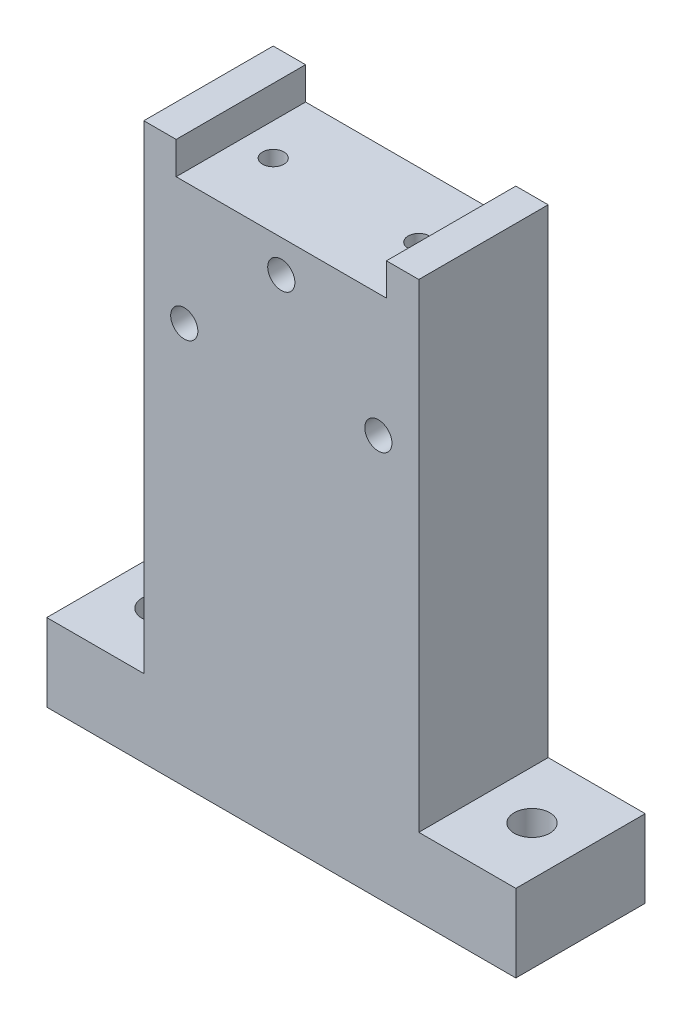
ISO-10303-21;
HEADER;
FILE_DESCRIPTION(('STEP AP214'),'2;1');
FILE_NAME('part.step','',(''),(''),'','','');
FILE_SCHEMA(('AUTOMOTIVE_DESIGN { 1 0 10303 214 1 1 1 1 }'));
ENDSEC;
DATA;
#1=APPLICATION_CONTEXT('core data for automotive mechanical design processes');
#2=APPLICATION_PROTOCOL_DEFINITION('international standard','automotive_design',2000,#1);
#3=PRODUCT_CONTEXT('',#1,'mechanical');
#4=PRODUCT('Part','Part','',(#3));
#5=PRODUCT_RELATED_PRODUCT_CATEGORY('part','',(#4));
#6=PRODUCT_DEFINITION_FORMATION('','',#4);
#7=PRODUCT_DEFINITION_CONTEXT('part definition',#1,'design');
#8=PRODUCT_DEFINITION('design','',#6,#7);
#9=PRODUCT_DEFINITION_SHAPE('','',#8);
#10=(LENGTH_UNIT() NAMED_UNIT(*) SI_UNIT(.MILLI.,.METRE.));
#11=(NAMED_UNIT(*) PLANE_ANGLE_UNIT() SI_UNIT($,.RADIAN.));
#12=(NAMED_UNIT(*) SI_UNIT($,.STERADIAN.) SOLID_ANGLE_UNIT());
#13=UNCERTAINTY_MEASURE_WITH_UNIT(LENGTH_MEASURE(1.E-05),#10,'distance_accuracy_value','');
#14=(GEOMETRIC_REPRESENTATION_CONTEXT(3) GLOBAL_UNCERTAINTY_ASSIGNED_CONTEXT((#13)) GLOBAL_UNIT_ASSIGNED_CONTEXT((#10,
#11,#12)) REPRESENTATION_CONTEXT('',''));
#15=CARTESIAN_POINT('',(0.,0.,0.));
#16=DIRECTION('',(0.,0.,1.));
#17=DIRECTION('',(1.,0.,0.));
#18=AXIS2_PLACEMENT_3D('',#15,#16,#17);
#19=CARTESIAN_POINT('',(20.0000000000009,80.9999999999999,20.));
#20=DIRECTION('',(0.,-1.,0.));
#21=DIRECTION('',(0.,0.,-1.));
#22=AXIS2_PLACEMENT_3D('',#19,#20,#21);
#23=PLANE('',#22);
#24=CARTESIAN_POINT('',(47.5,80.9999999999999,10.));
#25=DIRECTION('',(0.,1.,0.));
#26=DIRECTION('',(0.,0.,1.));
#27=AXIS2_PLACEMENT_3D('',#24,#25,#26);
#28=CIRCLE('',#27,1.65000000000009);
#29=CARTESIAN_POINT('',(47.5,80.9999999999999,11.6500000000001));
#30=VERTEX_POINT('',#29);
#31=EDGE_CURVE('E264',#30,#30,#28,.T.);
#32=ORIENTED_EDGE('',*,*,#31,.F.);
#33=EDGE_LOOP('',(#32));
#34=FACE_BOUND('',#33,.T.);
#35=CARTESIAN_POINT('',(25.,80.9999999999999,10.));
#36=DIRECTION('',(0.,1.,0.));
#37=DIRECTION('',(0.,0.,1.));
#38=AXIS2_PLACEMENT_3D('',#35,#36,#37);
#39=CIRCLE('',#38,1.65000000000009);
#40=CARTESIAN_POINT('',(25.,80.9999999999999,11.6500000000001));
#41=VERTEX_POINT('',#40);
#42=EDGE_CURVE('E267',#41,#41,#39,.T.);
#43=ORIENTED_EDGE('',*,*,#42,.F.);
#44=EDGE_LOOP('',(#43));
#45=FACE_BOUND('',#44,.T.);
#46=DIRECTION('',(-1.,0.,0.));
#47=VECTOR('',#46,1.);
#48=CARTESIAN_POINT('',(20.0000000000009,80.9999999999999,0.));
#49=LINE('',#48,#47);
#50=CARTESIAN_POINT('',(52.5000000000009,80.9999999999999,0.));
#51=VERTEX_POINT('',#50);
#52=CARTESIAN_POINT('',(20.0000000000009,80.9999999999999,0.));
#53=VERTEX_POINT('',#52);
#54=EDGE_CURVE('E153',#51,#53,#49,.T.);
#55=ORIENTED_EDGE('',*,*,#54,.T.);
#56=DIRECTION('',(0.,0.,-1.));
#57=VECTOR('',#56,1.);
#58=CARTESIAN_POINT('',(20.0000000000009,80.9999999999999,20.));
#59=LINE('',#58,#57);
#60=CARTESIAN_POINT('',(20.0000000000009,80.9999999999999,20.));
#61=VERTEX_POINT('',#60);
#62=EDGE_CURVE('E11',#61,#53,#59,.T.);
#63=ORIENTED_EDGE('',*,*,#62,.F.);
#64=DIRECTION('',(-1.,0.,0.));
#65=VECTOR('',#64,1.);
#66=CARTESIAN_POINT('',(20.0000000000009,80.9999999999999,20.));
#67=LINE('',#66,#65);
#68=CARTESIAN_POINT('',(52.5000000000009,80.9999999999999,20.));
#69=VERTEX_POINT('',#68);
#70=EDGE_CURVE('E176',#69,#61,#67,.T.);
#71=ORIENTED_EDGE('',*,*,#70,.F.);
#72=DIRECTION('',(0.,0.,-1.));
#73=VECTOR('',#72,1.);
#74=CARTESIAN_POINT('',(52.5000000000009,80.9999999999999,20.));
#75=LINE('',#74,#73);
#76=EDGE_CURVE('E149',#69,#51,#75,.T.);
#77=ORIENTED_EDGE('',*,*,#76,.T.);
#78=EDGE_LOOP('',(#55,#63,#71,#77));
#79=FACE_BOUND('',#78,.T.);
#80=ADVANCED_FACE('F32',(#34,#45,#79),#23,.F.);
#81=CARTESIAN_POINT('',(20.0000000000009,80.9999999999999,20.));
#82=DIRECTION('',(-1.,-1.8179902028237E-13,0.));
#83=DIRECTION('',(1.8179902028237E-13,-1.,0.));
#84=AXIS2_PLACEMENT_3D('',#81,#82,#83);
#85=PLANE('',#84);
#86=DIRECTION('',(-1.8179902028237E-13,1.,0.));
#87=VECTOR('',#86,1.);
#88=CARTESIAN_POINT('',(20.0000000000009,80.9999999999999,0.));
#89=LINE('',#88,#87);
#90=CARTESIAN_POINT('',(20.,85.9999999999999,0.));
#91=VERTEX_POINT('',#90);
#92=EDGE_CURVE('E156',#53,#91,#89,.T.);
#93=ORIENTED_EDGE('',*,*,#92,.T.);
#94=DIRECTION('',(0.,0.,-1.));
#95=VECTOR('',#94,1.);
#96=CARTESIAN_POINT('',(20.,85.9999999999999,20.));
#97=LINE('',#96,#95);
#98=CARTESIAN_POINT('',(20.,85.9999999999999,20.));
#99=VERTEX_POINT('',#98);
#100=EDGE_CURVE('E41',#99,#91,#97,.T.);
#101=ORIENTED_EDGE('',*,*,#100,.F.);
#102=DIRECTION('',(-1.8179902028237E-13,1.,0.));
#103=VECTOR('',#102,1.);
#104=CARTESIAN_POINT('',(20.0000000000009,80.9999999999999,20.));
#105=LINE('',#104,#103);
#106=EDGE_CURVE('E104',#61,#99,#105,.T.);
#107=ORIENTED_EDGE('',*,*,#106,.F.);
#108=ORIENTED_EDGE('',*,*,#62,.T.);
#109=EDGE_LOOP('',(#93,#101,#107,#108));
#110=FACE_BOUND('',#109,.T.);
#111=ADVANCED_FACE('F256',(#110),#85,.F.);
#112=CARTESIAN_POINT('',(15.,85.9999999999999,20.));
#113=DIRECTION('',(0.,-1.,0.));
#114=DIRECTION('',(0.,0.,-1.));
#115=AXIS2_PLACEMENT_3D('',#112,#113,#114);
#116=PLANE('',#115);
#117=DIRECTION('',(-1.,0.,0.));
#118=VECTOR('',#117,1.);
#119=CARTESIAN_POINT('',(15.,85.9999999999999,0.));
#120=LINE('',#119,#118);
#121=CARTESIAN_POINT('',(15.,85.9999999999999,0.));
#122=VERTEX_POINT('',#121);
#123=EDGE_CURVE('E159',#91,#122,#120,.T.);
#124=ORIENTED_EDGE('',*,*,#123,.T.);
#125=DIRECTION('',(0.,0.,-1.));
#126=VECTOR('',#125,1.);
#127=CARTESIAN_POINT('',(15.,85.9999999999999,20.));
#128=LINE('',#127,#126);
#129=CARTESIAN_POINT('',(15.,85.9999999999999,20.));
#130=VERTEX_POINT('',#129);
#131=EDGE_CURVE('E195',#130,#122,#128,.T.);
#132=ORIENTED_EDGE('',*,*,#131,.F.);
#133=DIRECTION('',(-1.,0.,0.));
#134=VECTOR('',#133,1.);
#135=CARTESIAN_POINT('',(15.,85.9999999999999,20.));
#136=LINE('',#135,#134);
#137=EDGE_CURVE('E204',#99,#130,#136,.T.);
#138=ORIENTED_EDGE('',*,*,#137,.F.);
#139=ORIENTED_EDGE('',*,*,#100,.T.);
#140=EDGE_LOOP('',(#124,#132,#138,#139));
#141=FACE_BOUND('',#140,.T.);
#142=ADVANCED_FACE('F202',(#141),#116,.F.);
#143=CARTESIAN_POINT('',(15.,12.,20.));
#144=DIRECTION('',(1.,0.,0.));
#145=DIRECTION('',(0.,0.,-1.));
#146=AXIS2_PLACEMENT_3D('',#143,#144,#145);
#147=PLANE('',#146);
#148=DIRECTION('',(0.,-1.,0.));
#149=VECTOR('',#148,1.);
#150=CARTESIAN_POINT('',(15.,12.,0.));
#151=LINE('',#150,#149);
#152=CARTESIAN_POINT('',(15.,12.,0.));
#153=VERTEX_POINT('',#152);
#154=EDGE_CURVE('E161',#122,#153,#151,.T.);
#155=ORIENTED_EDGE('',*,*,#154,.T.);
#156=DIRECTION('',(0.,0.,-1.));
#157=VECTOR('',#156,1.);
#158=CARTESIAN_POINT('',(15.,12.,20.));
#159=LINE('',#158,#157);
#160=CARTESIAN_POINT('',(15.,12.,20.));
#161=VERTEX_POINT('',#160);
#162=EDGE_CURVE('E192',#161,#153,#159,.T.);
#163=ORIENTED_EDGE('',*,*,#162,.F.);
#164=DIRECTION('',(0.,-1.,0.));
#165=VECTOR('',#164,1.);
#166=CARTESIAN_POINT('',(15.,12.,20.));
#167=LINE('',#166,#165);
#168=EDGE_CURVE('E222',#130,#161,#167,.T.);
#169=ORIENTED_EDGE('',*,*,#168,.F.);
#170=ORIENTED_EDGE('',*,*,#131,.T.);
#171=EDGE_LOOP('',(#155,#163,#169,#170));
#172=FACE_BOUND('',#171,.T.);
#173=ADVANCED_FACE('F213',(#172),#147,.F.);
#174=CARTESIAN_POINT('',(0.,12.,20.));
#175=DIRECTION('',(0.,-1.,0.));
#176=DIRECTION('',(0.,0.,-1.));
#177=AXIS2_PLACEMENT_3D('',#174,#175,#176);
#178=PLANE('',#177);
#179=CARTESIAN_POINT('',(7.5,12.,10.));
#180=DIRECTION('',(0.,1.,0.));
#181=DIRECTION('',(0.,0.,1.));
#182=AXIS2_PLACEMENT_3D('',#179,#180,#181);
#183=CIRCLE('',#182,2.75);
#184=CARTESIAN_POINT('',(7.5,12.,12.75));
#185=VERTEX_POINT('',#184);
#186=EDGE_CURVE('E284',#185,#185,#183,.T.);
#187=ORIENTED_EDGE('',*,*,#186,.F.);
#188=EDGE_LOOP('',(#187));
#189=FACE_BOUND('',#188,.T.);
#190=DIRECTION('',(-1.,0.,0.));
#191=VECTOR('',#190,1.);
#192=CARTESIAN_POINT('',(0.,12.,0.));
#193=LINE('',#192,#191);
#194=CARTESIAN_POINT('',(0.,12.,0.));
#195=VERTEX_POINT('',#194);
#196=EDGE_CURVE('E163',#153,#195,#193,.T.);
#197=ORIENTED_EDGE('',*,*,#196,.T.);
#198=DIRECTION('',(0.,0.,-1.));
#199=VECTOR('',#198,1.);
#200=CARTESIAN_POINT('',(0.,12.,20.));
#201=LINE('',#200,#199);
#202=CARTESIAN_POINT('',(0.,12.,20.));
#203=VERTEX_POINT('',#202);
#204=EDGE_CURVE('E189',#203,#195,#201,.T.);
#205=ORIENTED_EDGE('',*,*,#204,.F.);
#206=DIRECTION('',(-1.,0.,0.));
#207=VECTOR('',#206,1.);
#208=CARTESIAN_POINT('',(0.,12.,20.));
#209=LINE('',#208,#207);
#210=EDGE_CURVE('E219',#161,#203,#209,.T.);
#211=ORIENTED_EDGE('',*,*,#210,.F.);
#212=ORIENTED_EDGE('',*,*,#162,.T.);
#213=EDGE_LOOP('',(#197,#205,#211,#212));
#214=FACE_BOUND('',#213,.T.);
#215=ADVANCED_FACE('F217',(#189,#214),#178,.F.);
#216=CARTESIAN_POINT('',(0.,0.,20.));
#217=DIRECTION('',(1.,0.,0.));
#218=DIRECTION('',(0.,0.,-1.));
#219=AXIS2_PLACEMENT_3D('',#216,#217,#218);
#220=PLANE('',#219);
#221=DIRECTION('',(0.,-1.,0.));
#222=VECTOR('',#221,1.);
#223=CARTESIAN_POINT('',(0.,0.,0.));
#224=LINE('',#223,#222);
#225=CARTESIAN_POINT('',(0.,0.,0.));
#226=VERTEX_POINT('',#225);
#227=EDGE_CURVE('E165',#195,#226,#224,.T.);
#228=ORIENTED_EDGE('',*,*,#227,.T.);
#229=DIRECTION('',(0.,0.,-1.));
#230=VECTOR('',#229,1.);
#231=CARTESIAN_POINT('',(0.,0.,20.));
#232=LINE('',#231,#230);
#233=CARTESIAN_POINT('',(0.,0.,20.));
#234=VERTEX_POINT('',#233);
#235=EDGE_CURVE('E186',#234,#226,#232,.T.);
#236=ORIENTED_EDGE('',*,*,#235,.F.);
#237=DIRECTION('',(0.,-1.,0.));
#238=VECTOR('',#237,1.);
#239=CARTESIAN_POINT('',(0.,0.,20.));
#240=LINE('',#239,#238);
#241=EDGE_CURVE('E221',#203,#234,#240,.T.);
#242=ORIENTED_EDGE('',*,*,#241,.F.);
#243=ORIENTED_EDGE('',*,*,#204,.T.);
#244=EDGE_LOOP('',(#228,#236,#242,#243));
#245=FACE_BOUND('',#244,.T.);
#246=ADVANCED_FACE('F435',(#245),#220,.F.);
#247=CARTESIAN_POINT('',(0.,0.,20.));
#248=DIRECTION('',(0.,1.,0.));
#249=DIRECTION('',(0.,0.,1.));
#250=AXIS2_PLACEMENT_3D('',#247,#248,#249);
#251=PLANE('',#250);
#252=CARTESIAN_POINT('',(65.,0.,10.));
#253=DIRECTION('',(0.,1.,0.));
#254=DIRECTION('',(0.,0.,1.));
#255=AXIS2_PLACEMENT_3D('',#252,#253,#254);
#256=CIRCLE('',#255,2.75);
#257=CARTESIAN_POINT('',(65.,0.,12.75));
#258=VERTEX_POINT('',#257);
#259=EDGE_CURVE('E281',#258,#258,#256,.T.);
#260=ORIENTED_EDGE('',*,*,#259,.T.);
#261=EDGE_LOOP('',(#260));
#262=FACE_BOUND('',#261,.T.);
#263=CARTESIAN_POINT('',(7.5,0.,10.));
#264=DIRECTION('',(0.,1.,0.));
#265=DIRECTION('',(0.,0.,1.));
#266=AXIS2_PLACEMENT_3D('',#263,#264,#265);
#267=CIRCLE('',#266,2.75);
#268=CARTESIAN_POINT('',(7.5,0.,12.75));
#269=VERTEX_POINT('',#268);
#270=EDGE_CURVE('E35',#269,#269,#267,.T.);
#271=ORIENTED_EDGE('',*,*,#270,.T.);
#272=EDGE_LOOP('',(#271));
#273=FACE_BOUND('',#272,.T.);
#274=DIRECTION('',(1.,0.,0.));
#275=VECTOR('',#274,1.);
#276=CARTESIAN_POINT('',(0.,0.,0.));
#277=LINE('',#276,#275);
#278=CARTESIAN_POINT('',(72.5,0.,0.));
#279=VERTEX_POINT('',#278);
#280=EDGE_CURVE('E167',#226,#279,#277,.T.);
#281=ORIENTED_EDGE('',*,*,#280,.T.);
#282=DIRECTION('',(0.,0.,-1.));
#283=VECTOR('',#282,1.);
#284=CARTESIAN_POINT('',(72.5,0.,20.));
#285=LINE('',#284,#283);
#286=CARTESIAN_POINT('',(72.5,0.,20.));
#287=VERTEX_POINT('',#286);
#288=EDGE_CURVE('E183',#287,#279,#285,.T.);
#289=ORIENTED_EDGE('',*,*,#288,.F.);
#290=DIRECTION('',(1.,0.,0.));
#291=VECTOR('',#290,1.);
#292=CARTESIAN_POINT('',(0.,0.,20.));
#293=LINE('',#292,#291);
#294=EDGE_CURVE('E224',#234,#287,#293,.T.);
#295=ORIENTED_EDGE('',*,*,#294,.F.);
#296=ORIENTED_EDGE('',*,*,#235,.T.);
#297=EDGE_LOOP('',(#281,#289,#295,#296));
#298=FACE_BOUND('',#297,.T.);
#299=ADVANCED_FACE('F428',(#262,#273,#298),#251,.F.);
#300=CARTESIAN_POINT('',(72.5,0.,20.));
#301=DIRECTION('',(-1.,0.,0.));
#302=DIRECTION('',(0.,0.,1.));
#303=AXIS2_PLACEMENT_3D('',#300,#301,#302);
#304=PLANE('',#303);
#305=DIRECTION('',(0.,1.,0.));
#306=VECTOR('',#305,1.);
#307=CARTESIAN_POINT('',(72.5,0.,0.));
#308=LINE('',#307,#306);
#309=CARTESIAN_POINT('',(72.5,12.,0.));
#310=VERTEX_POINT('',#309);
#311=EDGE_CURVE('E169',#279,#310,#308,.T.);
#312=ORIENTED_EDGE('',*,*,#311,.T.);
#313=DIRECTION('',(0.,0.,-1.));
#314=VECTOR('',#313,1.);
#315=CARTESIAN_POINT('',(72.5,12.,20.));
#316=LINE('',#315,#314);
#317=CARTESIAN_POINT('',(72.5,12.,20.));
#318=VERTEX_POINT('',#317);
#319=EDGE_CURVE('E180',#318,#310,#316,.T.);
#320=ORIENTED_EDGE('',*,*,#319,.F.);
#321=DIRECTION('',(0.,1.,0.));
#322=VECTOR('',#321,1.);
#323=CARTESIAN_POINT('',(72.5,0.,20.));
#324=LINE('',#323,#322);
#325=EDGE_CURVE('E230',#287,#318,#324,.T.);
#326=ORIENTED_EDGE('',*,*,#325,.F.);
#327=ORIENTED_EDGE('',*,*,#288,.T.);
#328=EDGE_LOOP('',(#312,#320,#326,#327));
#329=FACE_BOUND('',#328,.T.);
#330=ADVANCED_FACE('F236',(#329),#304,.F.);
#331=CARTESIAN_POINT('',(57.5000000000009,12.,20.));
#332=DIRECTION('',(0.,-1.,0.));
#333=DIRECTION('',(0.,0.,-1.));
#334=AXIS2_PLACEMENT_3D('',#331,#332,#333);
#335=PLANE('',#334);
#336=CARTESIAN_POINT('',(65.,12.,10.));
#337=DIRECTION('',(0.,1.,0.));
#338=DIRECTION('',(0.,0.,1.));
#339=AXIS2_PLACEMENT_3D('',#336,#337,#338);
#340=CIRCLE('',#339,2.75);
#341=CARTESIAN_POINT('',(65.,12.,12.75));
#342=VERTEX_POINT('',#341);
#343=EDGE_CURVE('E273',#342,#342,#340,.T.);
#344=ORIENTED_EDGE('',*,*,#343,.F.);
#345=EDGE_LOOP('',(#344));
#346=FACE_BOUND('',#345,.T.);
#347=DIRECTION('',(-1.,0.,0.));
#348=VECTOR('',#347,1.);
#349=CARTESIAN_POINT('',(57.5000000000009,12.,0.));
#350=LINE('',#349,#348);
#351=CARTESIAN_POINT('',(57.5000000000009,12.,0.));
#352=VERTEX_POINT('',#351);
#353=EDGE_CURVE('E171',#310,#352,#350,.T.);
#354=ORIENTED_EDGE('',*,*,#353,.T.);
#355=DIRECTION('',(0.,0.,-1.));
#356=VECTOR('',#355,1.);
#357=CARTESIAN_POINT('',(57.5000000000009,12.,20.));
#358=LINE('',#357,#356);
#359=CARTESIAN_POINT('',(57.5000000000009,12.,20.));
#360=VERTEX_POINT('',#359);
#361=EDGE_CURVE('E144',#360,#352,#358,.T.);
#362=ORIENTED_EDGE('',*,*,#361,.F.);
#363=DIRECTION('',(-1.,0.,0.));
#364=VECTOR('',#363,1.);
#365=CARTESIAN_POINT('',(57.5000000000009,12.,20.));
#366=LINE('',#365,#364);
#367=EDGE_CURVE('E135',#318,#360,#366,.T.);
#368=ORIENTED_EDGE('',*,*,#367,.F.);
#369=ORIENTED_EDGE('',*,*,#319,.T.);
#370=EDGE_LOOP('',(#354,#362,#368,#369));
#371=FACE_BOUND('',#370,.T.);
#372=ADVANCED_FACE('F240',(#346,#371),#335,.F.);
#373=CARTESIAN_POINT('',(57.5000000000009,12.,20.));
#374=DIRECTION('',(-1.,0.,0.));
#375=DIRECTION('',(0.,-1.,0.));
#376=AXIS2_PLACEMENT_3D('',#373,#374,#375);
#377=PLANE('',#376);
#378=DIRECTION('',(0.,1.,0.));
#379=VECTOR('',#378,1.);
#380=CARTESIAN_POINT('',(57.5000000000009,12.,0.));
#381=LINE('',#380,#379);
#382=CARTESIAN_POINT('',(57.5,85.9999999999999,0.));
#383=VERTEX_POINT('',#382);
#384=EDGE_CURVE('E143',#352,#383,#381,.T.);
#385=ORIENTED_EDGE('',*,*,#384,.T.);
#386=DIRECTION('',(0.,0.,-1.));
#387=VECTOR('',#386,1.);
#388=CARTESIAN_POINT('',(57.5,85.9999999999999,20.));
#389=LINE('',#388,#387);
#390=CARTESIAN_POINT('',(57.5,85.9999999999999,20.));
#391=VERTEX_POINT('',#390);
#392=EDGE_CURVE('E140',#391,#383,#389,.T.);
#393=ORIENTED_EDGE('',*,*,#392,.F.);
#394=DIRECTION('',(0.,1.,0.));
#395=VECTOR('',#394,1.);
#396=CARTESIAN_POINT('',(57.5000000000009,12.,20.));
#397=LINE('',#396,#395);
#398=EDGE_CURVE('E129',#360,#391,#397,.T.);
#399=ORIENTED_EDGE('',*,*,#398,.F.);
#400=ORIENTED_EDGE('',*,*,#361,.T.);
#401=EDGE_LOOP('',(#385,#393,#399,#400));
#402=FACE_BOUND('',#401,.T.);
#403=ADVANCED_FACE('F141',(#402),#377,.F.);
#404=CARTESIAN_POINT('',(52.5,85.9999999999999,20.));
#405=DIRECTION('',(0.,-1.,0.));
#406=DIRECTION('',(0.,0.,-1.));
#407=AXIS2_PLACEMENT_3D('',#404,#405,#406);
#408=PLANE('',#407);
#409=DIRECTION('',(-1.,0.,0.));
#410=VECTOR('',#409,1.);
#411=CARTESIAN_POINT('',(52.5,85.9999999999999,0.));
#412=LINE('',#411,#410);
#413=CARTESIAN_POINT('',(52.5,85.9999999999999,0.));
#414=VERTEX_POINT('',#413);
#415=EDGE_CURVE('E90',#383,#414,#412,.T.);
#416=ORIENTED_EDGE('',*,*,#415,.T.);
#417=DIRECTION('',(0.,0.,-1.));
#418=VECTOR('',#417,1.);
#419=CARTESIAN_POINT('',(52.5,85.9999999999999,20.));
#420=LINE('',#419,#418);
#421=CARTESIAN_POINT('',(52.5,85.9999999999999,20.));
#422=VERTEX_POINT('',#421);
#423=EDGE_CURVE('E145',#422,#414,#420,.T.);
#424=ORIENTED_EDGE('',*,*,#423,.F.);
#425=DIRECTION('',(-1.,0.,0.));
#426=VECTOR('',#425,1.);
#427=CARTESIAN_POINT('',(52.5,85.9999999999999,20.));
#428=LINE('',#427,#426);
#429=EDGE_CURVE('E133',#391,#422,#428,.T.);
#430=ORIENTED_EDGE('',*,*,#429,.F.);
#431=ORIENTED_EDGE('',*,*,#392,.T.);
#432=EDGE_LOOP('',(#416,#424,#430,#431));
#433=FACE_BOUND('',#432,.T.);
#434=ADVANCED_FACE('F147',(#433),#408,.F.);
#435=CARTESIAN_POINT('',(52.5000000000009,80.9999999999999,20.));
#436=DIRECTION('',(1.,1.83186799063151E-13,0.));
#437=DIRECTION('',(-1.83186799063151E-13,1.,0.));
#438=AXIS2_PLACEMENT_3D('',#435,#436,#437);
#439=PLANE('',#438);
#440=DIRECTION('',(1.83186799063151E-13,-1.,0.));
#441=VECTOR('',#440,1.);
#442=CARTESIAN_POINT('',(52.5000000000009,80.9999999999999,0.));
#443=LINE('',#442,#441);
#444=EDGE_CURVE('E96',#414,#51,#443,.T.);
#445=ORIENTED_EDGE('',*,*,#444,.T.);
#446=ORIENTED_EDGE('',*,*,#76,.F.);
#447=DIRECTION('',(1.83186799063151E-13,-1.,0.));
#448=VECTOR('',#447,1.);
#449=CARTESIAN_POINT('',(52.5000000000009,80.9999999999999,20.));
#450=LINE('',#449,#448);
#451=EDGE_CURVE('E49',#422,#69,#450,.T.);
#452=ORIENTED_EDGE('',*,*,#451,.F.);
#453=ORIENTED_EDGE('',*,*,#423,.T.);
#454=EDGE_LOOP('',(#445,#446,#452,#453));
#455=FACE_BOUND('',#454,.T.);
#456=ADVANCED_FACE('F244',(#455),#439,.F.);
#457=CARTESIAN_POINT('',(52.5000000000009,80.9999999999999,20.));
#458=DIRECTION('',(0.,0.,1.));
#459=DIRECTION('',(1.,0.,0.));
#460=AXIS2_PLACEMENT_3D('',#457,#458,#459);
#461=PLANE('',#460);
#462=CARTESIAN_POINT('',(36.25,76.,20.));
#463=DIRECTION('',(0.,0.,1.));
#464=DIRECTION('',(1.,0.,0.));
#465=AXIS2_PLACEMENT_3D('',#462,#463,#464);
#466=CIRCLE('',#465,2.1);
#467=CARTESIAN_POINT('',(38.35,76.,20.));
#468=VERTEX_POINT('',#467);
#469=EDGE_CURVE('E291',#468,#468,#466,.T.);
#470=ORIENTED_EDGE('',*,*,#469,.F.);
#471=EDGE_LOOP('',(#470));
#472=FACE_BOUND('',#471,.T.);
#473=CARTESIAN_POINT('',(51.25,62.,20.));
#474=DIRECTION('',(0.,0.,1.));
#475=DIRECTION('',(1.,0.,0.));
#476=AXIS2_PLACEMENT_3D('',#473,#474,#475);
#477=CIRCLE('',#476,2.1);
#478=CARTESIAN_POINT('',(53.35,62.,20.));
#479=VERTEX_POINT('',#478);
#480=EDGE_CURVE('E290',#479,#479,#477,.T.);
#481=ORIENTED_EDGE('',*,*,#480,.F.);
#482=EDGE_LOOP('',(#481));
#483=FACE_BOUND('',#482,.T.);
#484=CARTESIAN_POINT('',(21.25,62.,20.));
#485=DIRECTION('',(0.,0.,1.));
#486=DIRECTION('',(1.,0.,0.));
#487=AXIS2_PLACEMENT_3D('',#484,#485,#486);
#488=CIRCLE('',#487,2.1);
#489=CARTESIAN_POINT('',(23.35,62.,20.));
#490=VERTEX_POINT('',#489);
#491=EDGE_CURVE('E297',#490,#490,#488,.T.);
#492=ORIENTED_EDGE('',*,*,#491,.F.);
#493=EDGE_LOOP('',(#492));
#494=FACE_BOUND('',#493,.T.);
#495=ORIENTED_EDGE('',*,*,#70,.T.);
#496=ORIENTED_EDGE('',*,*,#106,.T.);
#497=ORIENTED_EDGE('',*,*,#137,.T.);
#498=ORIENTED_EDGE('',*,*,#168,.T.);
#499=ORIENTED_EDGE('',*,*,#210,.T.);
#500=ORIENTED_EDGE('',*,*,#241,.T.);
#501=ORIENTED_EDGE('',*,*,#294,.T.);
#502=ORIENTED_EDGE('',*,*,#325,.T.);
#503=ORIENTED_EDGE('',*,*,#367,.T.);
#504=ORIENTED_EDGE('',*,*,#398,.T.);
#505=ORIENTED_EDGE('',*,*,#429,.T.);
#506=ORIENTED_EDGE('',*,*,#451,.T.);
#507=EDGE_LOOP('',(#495,#496,#497,#498,#499,#500,#501,#502,#503,#504,#505,#506));
#508=FACE_BOUND('',#507,.T.);
#509=ADVANCED_FACE('F131',(#472,#483,#494,#508),#461,.T.);
#510=CARTESIAN_POINT('',(52.5000000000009,80.9999999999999,0.));
#511=DIRECTION('',(0.,0.,1.));
#512=DIRECTION('',(1.,0.,0.));
#513=AXIS2_PLACEMENT_3D('',#510,#511,#512);
#514=PLANE('',#513);
#515=CARTESIAN_POINT('',(36.25,76.,0.));
#516=DIRECTION('',(0.,0.,1.));
#517=DIRECTION('',(1.,0.,0.));
#518=AXIS2_PLACEMENT_3D('',#515,#516,#517);
#519=CIRCLE('',#518,2.1);
#520=CARTESIAN_POINT('',(38.35,76.,0.));
#521=VERTEX_POINT('',#520);
#522=EDGE_CURVE('E287',#521,#521,#519,.T.);
#523=ORIENTED_EDGE('',*,*,#522,.T.);
#524=EDGE_LOOP('',(#523));
#525=FACE_BOUND('',#524,.T.);
#526=CARTESIAN_POINT('',(51.25,62.,0.));
#527=DIRECTION('',(0.,0.,1.));
#528=DIRECTION('',(1.,0.,0.));
#529=AXIS2_PLACEMENT_3D('',#526,#527,#528);
#530=CIRCLE('',#529,2.1);
#531=CARTESIAN_POINT('',(53.35,62.,0.));
#532=VERTEX_POINT('',#531);
#533=EDGE_CURVE('E294',#532,#532,#530,.T.);
#534=ORIENTED_EDGE('',*,*,#533,.T.);
#535=EDGE_LOOP('',(#534));
#536=FACE_BOUND('',#535,.T.);
#537=CARTESIAN_POINT('',(21.25,62.,0.));
#538=DIRECTION('',(0.,0.,1.));
#539=DIRECTION('',(1.,0.,0.));
#540=AXIS2_PLACEMENT_3D('',#537,#538,#539);
#541=CIRCLE('',#540,2.1);
#542=CARTESIAN_POINT('',(23.35,62.,0.));
#543=VERTEX_POINT('',#542);
#544=EDGE_CURVE('E157',#543,#543,#541,.T.);
#545=ORIENTED_EDGE('',*,*,#544,.T.);
#546=EDGE_LOOP('',(#545));
#547=FACE_BOUND('',#546,.T.);
#548=ORIENTED_EDGE('',*,*,#54,.F.);
#549=ORIENTED_EDGE('',*,*,#444,.F.);
#550=ORIENTED_EDGE('',*,*,#415,.F.);
#551=ORIENTED_EDGE('',*,*,#384,.F.);
#552=ORIENTED_EDGE('',*,*,#353,.F.);
#553=ORIENTED_EDGE('',*,*,#311,.F.);
#554=ORIENTED_EDGE('',*,*,#280,.F.);
#555=ORIENTED_EDGE('',*,*,#227,.F.);
#556=ORIENTED_EDGE('',*,*,#196,.F.);
#557=ORIENTED_EDGE('',*,*,#154,.F.);
#558=ORIENTED_EDGE('',*,*,#123,.F.);
#559=ORIENTED_EDGE('',*,*,#92,.F.);
#560=EDGE_LOOP('',(#548,#549,#550,#551,#552,#553,#554,#555,#556,#557,#558,#559));
#561=FACE_BOUND('',#560,.T.);
#562=ADVANCED_FACE('F208',(#525,#536,#547,#561),#514,.F.);
#563=CARTESIAN_POINT('',(21.25,62.,0.));
#564=DIRECTION('',(0.,0.,1.));
#565=DIRECTION('',(1.,0.,0.));
#566=AXIS2_PLACEMENT_3D('',#563,#564,#565);
#567=CYLINDRICAL_SURFACE('',#566,2.1);
#568=ORIENTED_EDGE('',*,*,#544,.F.);
#569=EDGE_LOOP('',(#568));
#570=FACE_BOUND('',#569,.T.);
#571=ORIENTED_EDGE('',*,*,#491,.T.);
#572=EDGE_LOOP('',(#571));
#573=FACE_BOUND('',#572,.T.);
#574=ADVANCED_FACE('F307',(#570,#573),#567,.F.);
#575=CARTESIAN_POINT('',(51.25,62.,0.));
#576=DIRECTION('',(0.,0.,1.));
#577=DIRECTION('',(1.,0.,0.));
#578=AXIS2_PLACEMENT_3D('',#575,#576,#577);
#579=CYLINDRICAL_SURFACE('',#578,2.1);
#580=ORIENTED_EDGE('',*,*,#533,.F.);
#581=EDGE_LOOP('',(#580));
#582=FACE_BOUND('',#581,.T.);
#583=ORIENTED_EDGE('',*,*,#480,.T.);
#584=EDGE_LOOP('',(#583));
#585=FACE_BOUND('',#584,.T.);
#586=ADVANCED_FACE('F310',(#582,#585),#579,.F.);
#587=CARTESIAN_POINT('',(36.25,76.,0.));
#588=DIRECTION('',(0.,0.,1.));
#589=DIRECTION('',(1.,0.,0.));
#590=AXIS2_PLACEMENT_3D('',#587,#588,#589);
#591=CYLINDRICAL_SURFACE('',#590,2.1);
#592=ORIENTED_EDGE('',*,*,#522,.F.);
#593=EDGE_LOOP('',(#592));
#594=FACE_BOUND('',#593,.T.);
#595=ORIENTED_EDGE('',*,*,#469,.T.);
#596=EDGE_LOOP('',(#595));
#597=FACE_BOUND('',#596,.T.);
#598=ADVANCED_FACE('F317',(#594,#597),#591,.F.);
#599=CARTESIAN_POINT('',(7.5,-8.,10.));
#600=DIRECTION('',(0.,1.,0.));
#601=DIRECTION('',(0.,0.,1.));
#602=AXIS2_PLACEMENT_3D('',#599,#600,#601);
#603=CYLINDRICAL_SURFACE('',#602,2.75);
#604=ORIENTED_EDGE('',*,*,#186,.T.);
#605=EDGE_LOOP('',(#604));
#606=FACE_BOUND('',#605,.T.);
#607=ORIENTED_EDGE('',*,*,#270,.F.);
#608=EDGE_LOOP('',(#607));
#609=FACE_BOUND('',#608,.T.);
#610=ADVANCED_FACE('F325',(#606,#609),#603,.F.);
#611=CARTESIAN_POINT('',(65.,-8.,10.));
#612=DIRECTION('',(0.,1.,0.));
#613=DIRECTION('',(0.,0.,1.));
#614=AXIS2_PLACEMENT_3D('',#611,#612,#613);
#615=CYLINDRICAL_SURFACE('',#614,2.75);
#616=ORIENTED_EDGE('',*,*,#343,.T.);
#617=EDGE_LOOP('',(#616));
#618=FACE_BOUND('',#617,.T.);
#619=ORIENTED_EDGE('',*,*,#259,.F.);
#620=EDGE_LOOP('',(#619));
#621=FACE_BOUND('',#620,.T.);
#622=ADVANCED_FACE('F329',(#618,#621),#615,.F.);
#623=CARTESIAN_POINT('',(25.,68.9999999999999,10.));
#624=DIRECTION('',(0.,1.,0.));
#625=DIRECTION('',(0.,0.,1.));
#626=AXIS2_PLACEMENT_3D('',#623,#624,#625);
#627=CYLINDRICAL_SURFACE('',#626,1.65000000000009);
#628=CARTESIAN_POINT('',(25.,68.9999999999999,10.));
#629=DIRECTION('',(0.,1.,0.));
#630=DIRECTION('',(0.,0.,1.));
#631=AXIS2_PLACEMENT_3D('',#628,#629,#630);
#632=CIRCLE('',#631,1.65000000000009);
#633=CARTESIAN_POINT('',(25.,68.9999999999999,11.6500000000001));
#634=VERTEX_POINT('',#633);
#635=EDGE_CURVE('E269',#634,#634,#632,.T.);
#636=ORIENTED_EDGE('',*,*,#635,.F.);
#637=EDGE_LOOP('',(#636));
#638=FACE_BOUND('',#637,.T.);
#639=ORIENTED_EDGE('',*,*,#42,.T.);
#640=EDGE_LOOP('',(#639));
#641=FACE_BOUND('',#640,.T.);
#642=ADVANCED_FACE('F333',(#638,#641),#627,.F.);
#643=CARTESIAN_POINT('',(25.,68.9999999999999,10.));
#644=DIRECTION('',(0.,1.,0.));
#645=DIRECTION('',(0.,0.,1.));
#646=AXIS2_PLACEMENT_3D('',#643,#644,#645);
#647=PLANE('',#646);
#648=ORIENTED_EDGE('',*,*,#635,.T.);
#649=EDGE_LOOP('',(#648));
#650=FACE_BOUND('',#649,.T.);
#651=ADVANCED_FACE('F337',(#650),#647,.T.);
#652=CARTESIAN_POINT('',(47.5,68.9999999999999,10.));
#653=DIRECTION('',(0.,1.,0.));
#654=DIRECTION('',(0.,0.,1.));
#655=AXIS2_PLACEMENT_3D('',#652,#653,#654);
#656=CYLINDRICAL_SURFACE('',#655,1.65000000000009);
#657=CARTESIAN_POINT('',(47.5,68.9999999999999,10.));
#658=DIRECTION('',(0.,1.,0.));
#659=DIRECTION('',(0.,0.,1.));
#660=AXIS2_PLACEMENT_3D('',#657,#658,#659);
#661=CIRCLE('',#660,1.65000000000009);
#662=CARTESIAN_POINT('',(47.5,68.9999999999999,11.6500000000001));
#663=VERTEX_POINT('',#662);
#664=EDGE_CURVE('E270',#663,#663,#661,.T.);
#665=ORIENTED_EDGE('',*,*,#664,.F.);
#666=EDGE_LOOP('',(#665));
#667=FACE_BOUND('',#666,.T.);
#668=ORIENTED_EDGE('',*,*,#31,.T.);
#669=EDGE_LOOP('',(#668));
#670=FACE_BOUND('',#669,.T.);
#671=ADVANCED_FACE('F341',(#667,#670),#656,.F.);
#672=CARTESIAN_POINT('',(47.5,68.9999999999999,10.));
#673=DIRECTION('',(0.,1.,0.));
#674=DIRECTION('',(0.,0.,1.));
#675=AXIS2_PLACEMENT_3D('',#672,#673,#674);
#676=PLANE('',#675);
#677=ORIENTED_EDGE('',*,*,#664,.T.);
#678=EDGE_LOOP('',(#677));
#679=FACE_BOUND('',#678,.T.);
#680=ADVANCED_FACE('F345',(#679),#676,.T.);
#681=CLOSED_SHELL('',(#80,#111,#142,#173,#215,#246,#299,#330,#372,#403,#434,#456,#509,#562,#574,
#586,#598,#610,#622,#642,#651,#671,#680));
#682=MANIFOLD_SOLID_BREP('B2',#681);
#683=ADVANCED_BREP_SHAPE_REPRESENTATION('',(#18,#682),#14);
#684=SHAPE_DEFINITION_REPRESENTATION(#9,#683);
ENDSEC;
END-ISO-10303-21;
